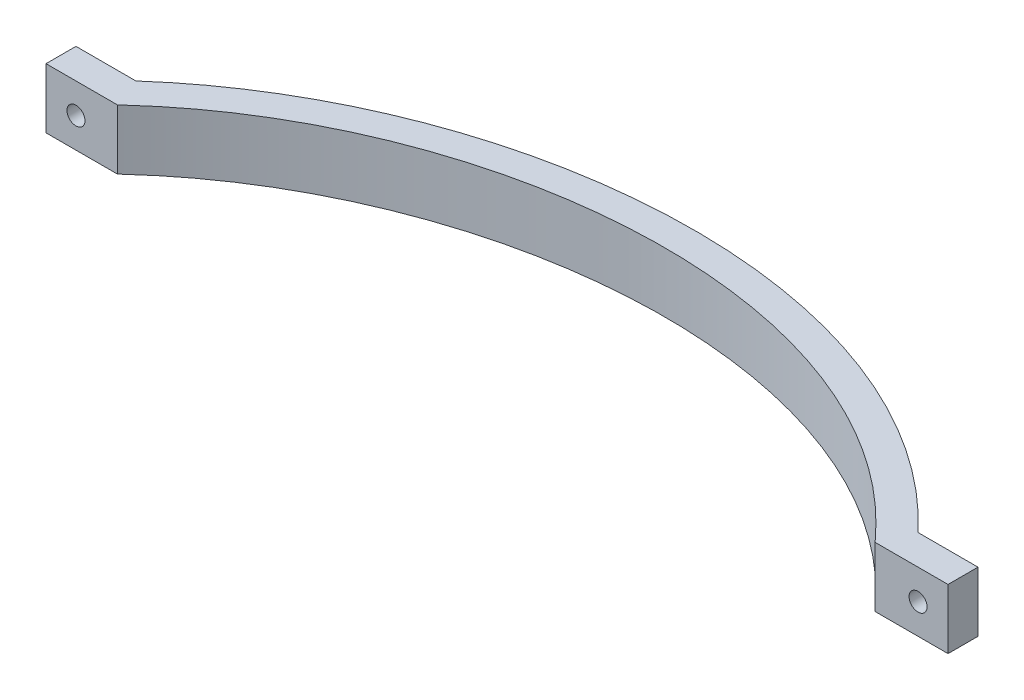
from build123d import *

# Parameters (mm, degrees)
BOSS_EXTRUDE1_DEPTH = 10
SKETCH2_R           = 1.5
CUT_EXTRUDE1_DEPTH  = 5


with BuildPart() as part:
    # Sketch1 → Boss-Extrude1 (new body)
    with BuildSketch(Plane(origin=(0, 0, 0), x_dir=(1, 0, 0), z_dir=(0, 1, 0))):
        with BuildLine():
            Line((-64.846605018, 0), (-54.846605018, 0))
            add(Edge.make_bspline(
                [(-54.846605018, 0), (-19.978022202, 31.037146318), (42.02403501, 35.618639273), (75.635668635, 0)],
                knots=[0, 0, 0, 0, 1, 1, 1, 1], degree=3))
            Line((75.635668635, 0), (85.635668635, 0))
            Line((85.635668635, 0), (85.635668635, -5))
            Line((85.635668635, -5), (73.479195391, -5))
            add(Edge.make_bspline(
                [(-52.943645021, -5), (-52.388402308, -4.505768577), (-51.532886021, -3.738345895), (-50.48149839, -2.820887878), (-48.855995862, -1.441021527), (-45.24283807, 1.433631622), (-39.300824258, 5.479681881), (-31.664459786, 9.68616053), (-20.916846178, 14.399306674), (-6.648287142, 18.541897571), (11.080804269, 20.524118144), (28.683434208, 19.3561638), (42.648401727, 15.649674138), (53.062694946, 10.988729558), (59.19209315, 7.356294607), (63.831681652, 4.008686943), (66.61355287, 1.730417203), (68.765525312, -0.206923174), (70.07565179, -1.462986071), (71.11040666, -2.502509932), (72.108328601, -3.540313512), (72.94231092, -4.43105728), (73.479195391, -5)],
                knots=[-0.013588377, -0.013588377, -0.013588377, -0.013588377, 0.002478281, 0.01051161, 0.01854494, 0.050678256, 0.114944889, 0.179211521, 0.243478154, 0.372011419, 0.500544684, 0.62907795, 0.757611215, 0.821877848, 0.88614448, 0.918277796, 0.950411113, 0.966477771, 0.982544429, 0.990577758, 0.998611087, 1.014677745, 1.014677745, 1.014677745, 1.014677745], degree=3))
            Line((-52.943645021, -5), (-64.846605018, -5))
            Line((-64.846605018, -5), (-64.846605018, 0))
        make_face()
    extrude(amount=BOSS_EXTRUDE1_DEPTH)

    # Sketch2 → Cut-Extrude1 (cut)
    with BuildSketch(Plane(origin=(0, 0, 0), x_dir=(-1, 0, 0), z_dir=(0, 0, -1))):
        with Locations((59.846605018, 5)):
            Circle(SKETCH2_R)
        with Locations((-80.635668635, 5)):
            Circle(SKETCH2_R)
    extrude(amount=-CUT_EXTRUDE1_DEPTH, mode=Mode.SUBTRACT)


solid = part.part
